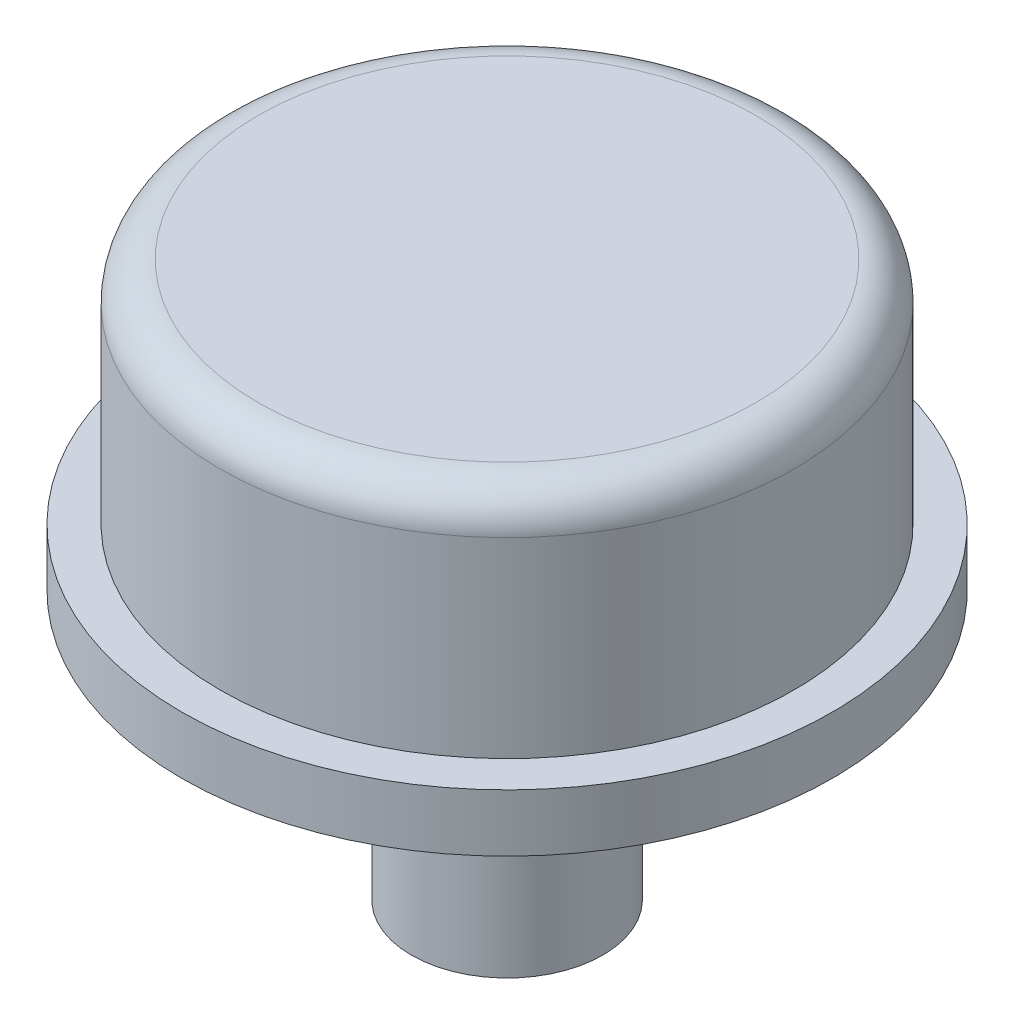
from build123d import *

# Parameters (mm, degrees)
CONG_2_R = 1


with BuildPart() as part:
    # Esquisse1 → R_volution5 (revolve)
    with BuildSketch(Plane.XY, mode=Mode.PRIVATE) as r_volution5_sk:
        Polygon((-7.5, 0), (-8.5, 0), (-8.5, -1.5), (-2.5, -1.5), (-2.5, -8.5), (0, -8.5), (0, 6), (-7.5, 6), align=None)
    revolve(r_volution5_sk.sketch.rotate(Axis((0, 63.381810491, 0), (0, -1, 0)), 270), axis=Axis((0, 63.381810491, 0), (0, -1, 0)))

    # Cong_2
    cong_2_edges = [part.edges().sort_by_distance(p)[0] for p in [
        (0, 6, -7.5),
    ]]
    fillet(cong_2_edges, radius=CONG_2_R)


solid = part.part
